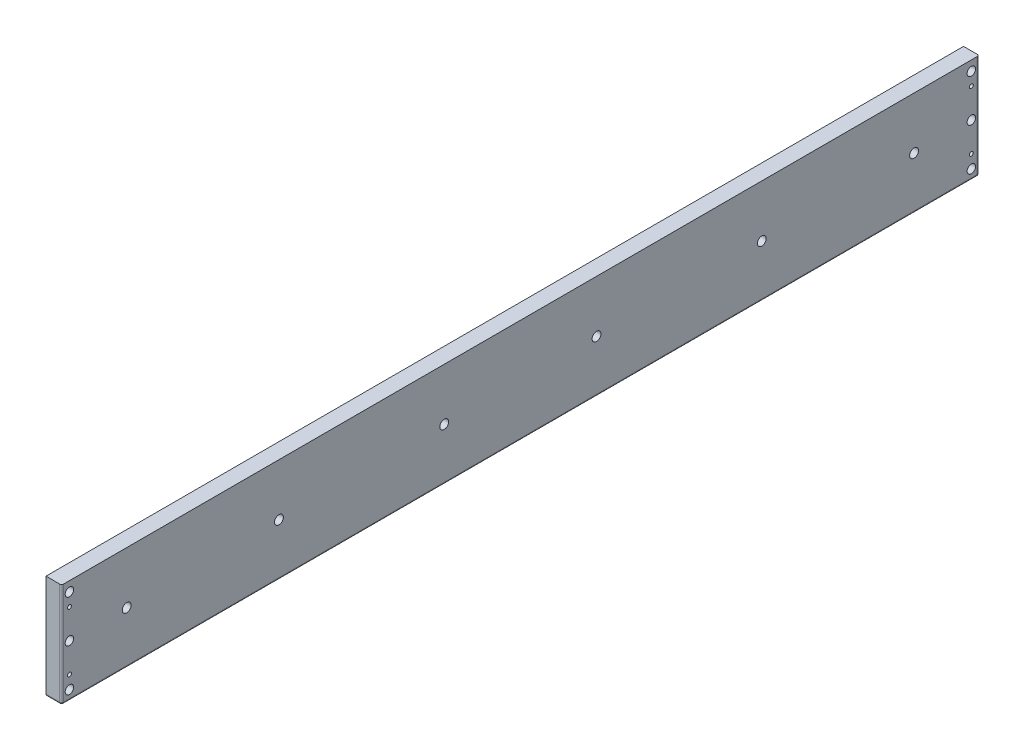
ISO-10303-21;
HEADER;
FILE_DESCRIPTION(('STEP AP214'),'2;1');
FILE_NAME('part.step','',(''),(''),'','','');
FILE_SCHEMA(('AUTOMOTIVE_DESIGN { 1 0 10303 214 1 1 1 1 }'));
ENDSEC;
DATA;
#1=APPLICATION_CONTEXT('core data for automotive mechanical design processes');
#2=APPLICATION_PROTOCOL_DEFINITION('international standard','automotive_design',2000,#1);
#3=PRODUCT_CONTEXT('',#1,'mechanical');
#4=PRODUCT('Part','Part','',(#3));
#5=PRODUCT_RELATED_PRODUCT_CATEGORY('part','',(#4));
#6=PRODUCT_DEFINITION_FORMATION('','',#4);
#7=PRODUCT_DEFINITION_CONTEXT('part definition',#1,'design');
#8=PRODUCT_DEFINITION('design','',#6,#7);
#9=PRODUCT_DEFINITION_SHAPE('','',#8);
#10=(LENGTH_UNIT() NAMED_UNIT(*) SI_UNIT(.MILLI.,.METRE.));
#11=(NAMED_UNIT(*) PLANE_ANGLE_UNIT() SI_UNIT($,.RADIAN.));
#12=(NAMED_UNIT(*) SI_UNIT($,.STERADIAN.) SOLID_ANGLE_UNIT());
#13=UNCERTAINTY_MEASURE_WITH_UNIT(LENGTH_MEASURE(1.E-05),#10,'distance_accuracy_value','');
#14=(GEOMETRIC_REPRESENTATION_CONTEXT(3) GLOBAL_UNCERTAINTY_ASSIGNED_CONTEXT((#13)) GLOBAL_UNIT_ASSIGNED_CONTEXT((#10,
#11,#12)) REPRESENTATION_CONTEXT('',''));
#15=CARTESIAN_POINT('',(0.,0.,0.));
#16=DIRECTION('',(0.,0.,1.));
#17=DIRECTION('',(1.,0.,0.));
#18=AXIS2_PLACEMENT_3D('',#15,#16,#17);
#19=CARTESIAN_POINT('',(4.50000000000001,-38.5,351.));
#20=DIRECTION('',(1.,0.,0.));
#21=DIRECTION('',(0.,0.,-1.));
#22=AXIS2_PLACEMENT_3D('',#19,#20,#21);
#23=SPHERICAL_SURFACE('',#22,1.5);
#24=CARTESIAN_POINT('',(4.50000000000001,-38.5,351.));
#25=DIRECTION('',(0.,0.,-1.));
#26=DIRECTION('',(-1.,0.,0.));
#27=AXIS2_PLACEMENT_3D('',#24,#25,#26);
#28=CIRCLE('',#27,1.5);
#29=CARTESIAN_POINT('',(6.00000000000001,-38.5,351.));
#30=VERTEX_POINT('',#29);
#31=CARTESIAN_POINT('',(4.50000000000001,-40.,351.));
#32=VERTEX_POINT('',#31);
#33=EDGE_CURVE('E105',#30,#32,#28,.T.);
#34=ORIENTED_EDGE('',*,*,#33,.F.);
#35=CARTESIAN_POINT('',(4.50000000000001,-38.5,351.));
#36=DIRECTION('',(0.,-1.,0.));
#37=DIRECTION('',(1.,0.,0.));
#38=AXIS2_PLACEMENT_3D('',#35,#36,#37);
#39=CIRCLE('',#38,1.5);
#40=CARTESIAN_POINT('',(4.50000000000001,-38.5,352.5));
#41=VERTEX_POINT('',#40);
#42=EDGE_CURVE('E122',#41,#30,#39,.F.);
#43=ORIENTED_EDGE('',*,*,#42,.F.);
#44=CARTESIAN_POINT('',(4.50000000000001,-38.5,351.));
#45=DIRECTION('',(-1.,0.,0.));
#46=DIRECTION('',(0.,0.,1.));
#47=AXIS2_PLACEMENT_3D('',#44,#45,#46);
#48=CIRCLE('',#47,1.5);
#49=EDGE_CURVE('E112',#32,#41,#48,.T.);
#50=ORIENTED_EDGE('',*,*,#49,.F.);
#51=EDGE_LOOP('',(#34,#43,#50));
#52=FACE_BOUND('',#51,.T.);
#53=ADVANCED_FACE('F16',(#52),#23,.T.);
#54=CARTESIAN_POINT('',(4.50000000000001,-38.5,-351.));
#55=DIRECTION('',(1.,0.,0.));
#56=DIRECTION('',(0.,0.,-1.));
#57=AXIS2_PLACEMENT_3D('',#54,#55,#56);
#58=SPHERICAL_SURFACE('',#57,1.5);
#59=CARTESIAN_POINT('',(4.50000000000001,-38.5,-351.));
#60=DIRECTION('',(0.,1.,0.));
#61=DIRECTION('',(-1.,0.,0.));
#62=AXIS2_PLACEMENT_3D('',#59,#60,#61);
#63=CIRCLE('',#62,1.5);
#64=CARTESIAN_POINT('',(6.00000000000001,-38.5,-351.));
#65=VERTEX_POINT('',#64);
#66=CARTESIAN_POINT('',(4.50000000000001,-38.5,-352.5));
#67=VERTEX_POINT('',#66);
#68=EDGE_CURVE('E70',#65,#67,#63,.T.);
#69=ORIENTED_EDGE('',*,*,#68,.F.);
#70=CARTESIAN_POINT('',(4.50000000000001,-38.5,-351.));
#71=DIRECTION('',(0.,0.,-1.));
#72=DIRECTION('',(-1.,0.,0.));
#73=AXIS2_PLACEMENT_3D('',#70,#71,#72);
#74=CIRCLE('',#73,1.5);
#75=CARTESIAN_POINT('',(4.50000000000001,-40.,-351.));
#76=VERTEX_POINT('',#75);
#77=EDGE_CURVE('E97',#76,#65,#74,.F.);
#78=ORIENTED_EDGE('',*,*,#77,.F.);
#79=CARTESIAN_POINT('',(4.50000000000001,-38.5,-351.));
#80=DIRECTION('',(1.,0.,0.));
#81=DIRECTION('',(0.,0.,-1.));
#82=AXIS2_PLACEMENT_3D('',#79,#80,#81);
#83=CIRCLE('',#82,1.5);
#84=EDGE_CURVE('E100',#67,#76,#83,.F.);
#85=ORIENTED_EDGE('',*,*,#84,.F.);
#86=EDGE_LOOP('',(#69,#78,#85));
#87=FACE_BOUND('',#86,.T.);
#88=ADVANCED_FACE('F99',(#87),#58,.T.);
#89=CARTESIAN_POINT('',(4.50000000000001,-38.5,352.5));
#90=DIRECTION('',(0.,0.,-1.));
#91=DIRECTION('',(-1.,0.,0.));
#92=AXIS2_PLACEMENT_3D('',#89,#90,#91);
#93=CYLINDRICAL_SURFACE('',#92,1.5);
#94=ORIENTED_EDGE('',*,*,#33,.T.);
#95=DIRECTION('',(0.,0.,1.));
#96=VECTOR('',#95,1.);
#97=CARTESIAN_POINT('',(4.50000000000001,-40.,352.5));
#98=LINE('',#97,#96);
#99=EDGE_CURVE('E115',#32,#76,#98,.F.);
#100=ORIENTED_EDGE('',*,*,#99,.T.);
#101=ORIENTED_EDGE('',*,*,#77,.T.);
#102=DIRECTION('',(0.,0.,1.));
#103=VECTOR('',#102,1.);
#104=CARTESIAN_POINT('',(6.00000000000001,-38.5,352.5));
#105=LINE('',#104,#103);
#106=EDGE_CURVE('E153',#65,#30,#105,.T.);
#107=ORIENTED_EDGE('',*,*,#106,.T.);
#108=EDGE_LOOP('',(#94,#100,#101,#107));
#109=FACE_BOUND('',#108,.T.);
#110=ADVANCED_FACE('F116',(#109),#93,.T.);
#111=CARTESIAN_POINT('',(4.50000000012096,22.5,300.));
#112=DIRECTION('',(-1.,0.,0.));
#113=DIRECTION('',(0.,0.,1.));
#114=AXIS2_PLACEMENT_3D('',#111,#112,#113);
#115=CONICAL_SURFACE('',#114,1.64999999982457,1.04719755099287);
#116=CARTESIAN_POINT('',(5.45262794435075,22.5,299.999999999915));
#117=VERTEX_POINT('',#116);
#118=VERTEX_LOOP('',#117);
#119=FACE_BOUND('',#118,.T.);
#120=CARTESIAN_POINT('',(4.5,22.5,300.));
#121=DIRECTION('',(-1.,0.,0.));
#122=DIRECTION('',(0.,0.,1.));
#123=AXIS2_PLACEMENT_3D('',#120,#121,#122);
#124=CIRCLE('',#123,1.64999999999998);
#125=CARTESIAN_POINT('',(4.5,22.5,301.65));
#126=VERTEX_POINT('',#125);
#127=EDGE_CURVE('E163',#126,#126,#124,.T.);
#128=ORIENTED_EDGE('',*,*,#127,.T.);
#129=EDGE_LOOP('',(#128));
#130=FACE_BOUND('',#129,.T.);
#131=ADVANCED_FACE('F181',(#119,#130),#115,.F.);
#132=CARTESIAN_POINT('',(4.50000000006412,22.4999999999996,240.));
#133=DIRECTION('',(-1.,0.,0.));
#134=DIRECTION('',(0.,0.,1.));
#135=AXIS2_PLACEMENT_3D('',#132,#133,#134);
#136=CONICAL_SURFACE('',#135,1.64999999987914,1.04719755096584);
#137=CARTESIAN_POINT('',(5.45262794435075,22.4999999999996,239.999999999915));
#138=VERTEX_POINT('',#137);
#139=VERTEX_LOOP('',#138);
#140=FACE_BOUND('',#139,.T.);
#141=CARTESIAN_POINT('',(4.5,22.4999999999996,240.));
#142=DIRECTION('',(-1.,0.,0.));
#143=DIRECTION('',(0.,0.,1.));
#144=AXIS2_PLACEMENT_3D('',#141,#142,#143);
#145=CIRCLE('',#144,1.64999999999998);
#146=CARTESIAN_POINT('',(4.5,22.4999999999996,241.65));
#147=VERTEX_POINT('',#146);
#148=EDGE_CURVE('E160',#147,#147,#145,.T.);
#149=ORIENTED_EDGE('',*,*,#148,.T.);
#150=EDGE_LOOP('',(#149));
#151=FACE_BOUND('',#150,.T.);
#152=ADVANCED_FACE('F184',(#140,#151),#136,.F.);
#153=CARTESIAN_POINT('',(4.50000000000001,-40.,351.));
#154=DIRECTION('',(0.,-1.,0.));
#155=DIRECTION('',(1.,0.,0.));
#156=AXIS2_PLACEMENT_3D('',#153,#154,#155);
#157=CYLINDRICAL_SURFACE('',#156,1.5);
#158=CARTESIAN_POINT('',(4.5,40.,351.));
#159=DIRECTION('',(0.,-1.,0.));
#160=DIRECTION('',(1.,0.,0.));
#161=AXIS2_PLACEMENT_3D('',#158,#159,#160);
#162=CIRCLE('',#161,1.5);
#163=CARTESIAN_POINT('',(6.,40.,351.));
#164=VERTEX_POINT('',#163);
#165=CARTESIAN_POINT('',(4.5,40.,352.5));
#166=VERTEX_POINT('',#165);
#167=EDGE_CURVE('E515',#164,#166,#162,.T.);
#168=ORIENTED_EDGE('',*,*,#167,.T.);
#169=DIRECTION('',(0.,1.,0.));
#170=VECTOR('',#169,1.);
#171=CARTESIAN_POINT('',(4.50000000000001,-40.,352.5));
#172=LINE('',#171,#170);
#173=EDGE_CURVE('E140',#41,#166,#172,.T.);
#174=ORIENTED_EDGE('',*,*,#173,.F.);
#175=ORIENTED_EDGE('',*,*,#42,.T.);
#176=DIRECTION('',(0.,-1.,0.));
#177=VECTOR('',#176,1.);
#178=CARTESIAN_POINT('',(6.,40.,351.));
#179=LINE('',#178,#177);
#180=EDGE_CURVE('E156',#30,#164,#179,.F.);
#181=ORIENTED_EDGE('',*,*,#180,.T.);
#182=EDGE_LOOP('',(#168,#174,#175,#181));
#183=FACE_BOUND('',#182,.T.);
#184=ADVANCED_FACE('F188',(#183),#157,.T.);
#185=CARTESIAN_POINT('',(-5.99999999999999,-40.,352.5));
#186=DIRECTION('',(0.,1.,0.));
#187=DIRECTION('',(0.,0.,1.));
#188=AXIS2_PLACEMENT_3D('',#185,#186,#187);
#189=PLANE('',#188);
#190=DIRECTION('',(0.,0.,-1.));
#191=VECTOR('',#190,1.);
#192=CARTESIAN_POINT('',(-4.49999999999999,-40.,352.5));
#193=LINE('',#192,#191);
#194=CARTESIAN_POINT('',(-4.49999999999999,-40.,-351.));
#195=VERTEX_POINT('',#194);
#196=CARTESIAN_POINT('',(-4.49999999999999,-40.,351.));
#197=VERTEX_POINT('',#196);
#198=EDGE_CURVE('E126',#195,#197,#193,.F.);
#199=ORIENTED_EDGE('',*,*,#198,.F.);
#200=DIRECTION('',(1.,0.,0.));
#201=VECTOR('',#200,1.);
#202=CARTESIAN_POINT('',(-5.99999999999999,-40.,-351.));
#203=LINE('',#202,#201);
#204=EDGE_CURVE('E110',#76,#195,#203,.F.);
#205=ORIENTED_EDGE('',*,*,#204,.F.);
#206=ORIENTED_EDGE('',*,*,#99,.F.);
#207=DIRECTION('',(-1.,0.,0.));
#208=VECTOR('',#207,1.);
#209=CARTESIAN_POINT('',(-5.99999999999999,-40.,351.));
#210=LINE('',#209,#208);
#211=EDGE_CURVE('E121',#197,#32,#210,.F.);
#212=ORIENTED_EDGE('',*,*,#211,.F.);
#213=EDGE_LOOP('',(#199,#205,#206,#212));
#214=FACE_BOUND('',#213,.T.);
#215=ADVANCED_FACE('F125',(#214),#189,.F.);
#216=CARTESIAN_POINT('',(-5.99999999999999,-38.5,351.));
#217=DIRECTION('',(-1.,0.,0.));
#218=DIRECTION('',(0.,0.,1.));
#219=AXIS2_PLACEMENT_3D('',#216,#217,#218);
#220=CYLINDRICAL_SURFACE('',#219,1.5);
#221=ORIENTED_EDGE('',*,*,#49,.T.);
#222=DIRECTION('',(1.,0.,0.));
#223=VECTOR('',#222,1.);
#224=CARTESIAN_POINT('',(-5.99999999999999,-38.5,352.5));
#225=LINE('',#224,#223);
#226=CARTESIAN_POINT('',(-5.99999999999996,-38.5,352.5));
#227=VERTEX_POINT('',#226);
#228=EDGE_CURVE('E143',#227,#41,#225,.T.);
#229=ORIENTED_EDGE('',*,*,#228,.F.);
#230=CARTESIAN_POINT('',(-4.49999999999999,-38.5,351.));
#231=DIRECTION('',(-0.707106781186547,0.,-0.707106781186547));
#232=DIRECTION('',(0.707106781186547,0.,-0.707106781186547));
#233=AXIS2_PLACEMENT_3D('',#230,#231,#232);
#234=ELLIPSE('',#233,2.12132034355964,1.5);
#235=EDGE_CURVE('E511',#197,#227,#234,.T.);
#236=ORIENTED_EDGE('',*,*,#235,.F.);
#237=ORIENTED_EDGE('',*,*,#211,.T.);
#238=EDGE_LOOP('',(#221,#229,#236,#237));
#239=FACE_BOUND('',#238,.T.);
#240=ADVANCED_FACE('F195',(#239),#220,.T.);
#241=CARTESIAN_POINT('',(-5.99999999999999,-38.5,-351.));
#242=DIRECTION('',(1.,0.,0.));
#243=DIRECTION('',(0.,0.,-1.));
#244=AXIS2_PLACEMENT_3D('',#241,#242,#243);
#245=CYLINDRICAL_SURFACE('',#244,1.5);
#246=ORIENTED_EDGE('',*,*,#84,.T.);
#247=ORIENTED_EDGE('',*,*,#204,.T.);
#248=CARTESIAN_POINT('',(-4.49999999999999,-38.5,-351.));
#249=DIRECTION('',(0.707106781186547,0.,-0.707106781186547));
#250=DIRECTION('',(-0.707106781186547,0.,-0.707106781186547));
#251=AXIS2_PLACEMENT_3D('',#248,#249,#250);
#252=ELLIPSE('',#251,2.12132034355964,1.5);
#253=CARTESIAN_POINT('',(-5.99999999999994,-38.5,-352.5));
#254=VERTEX_POINT('',#253);
#255=EDGE_CURVE('E513',#254,#195,#252,.F.);
#256=ORIENTED_EDGE('',*,*,#255,.F.);
#257=DIRECTION('',(1.,0.,0.));
#258=VECTOR('',#257,1.);
#259=CARTESIAN_POINT('',(-5.99999999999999,-38.5,-352.5));
#260=LINE('',#259,#258);
#261=EDGE_CURVE('E35',#254,#67,#260,.T.);
#262=ORIENTED_EDGE('',*,*,#261,.T.);
#263=EDGE_LOOP('',(#246,#247,#256,#262));
#264=FACE_BOUND('',#263,.T.);
#265=ADVANCED_FACE('F108',(#264),#245,.T.);
#266=CARTESIAN_POINT('',(4.5,40.,-351.));
#267=DIRECTION('',(0.,1.,0.));
#268=DIRECTION('',(-1.,0.,0.));
#269=AXIS2_PLACEMENT_3D('',#266,#267,#268);
#270=CYLINDRICAL_SURFACE('',#269,1.5);
#271=ORIENTED_EDGE('',*,*,#68,.T.);
#272=DIRECTION('',(0.,1.,0.));
#273=VECTOR('',#272,1.);
#274=CARTESIAN_POINT('',(4.50000000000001,-40.,-352.5));
#275=LINE('',#274,#273);
#276=CARTESIAN_POINT('',(4.5,40.,-352.5));
#277=VERTEX_POINT('',#276);
#278=EDGE_CURVE('E615',#67,#277,#275,.T.);
#279=ORIENTED_EDGE('',*,*,#278,.T.);
#280=CARTESIAN_POINT('',(4.5,40.,-351.));
#281=DIRECTION('',(0.,1.,0.));
#282=DIRECTION('',(-1.,0.,0.));
#283=AXIS2_PLACEMENT_3D('',#280,#281,#282);
#284=CIRCLE('',#283,1.5);
#285=CARTESIAN_POINT('',(6.,40.,-351.));
#286=VERTEX_POINT('',#285);
#287=EDGE_CURVE('E60',#277,#286,#284,.F.);
#288=ORIENTED_EDGE('',*,*,#287,.T.);
#289=DIRECTION('',(0.,-1.,0.));
#290=VECTOR('',#289,1.);
#291=CARTESIAN_POINT('',(6.,40.,-351.));
#292=LINE('',#291,#290);
#293=EDGE_CURVE('E128',#286,#65,#292,.T.);
#294=ORIENTED_EDGE('',*,*,#293,.T.);
#295=EDGE_LOOP('',(#271,#279,#288,#294));
#296=FACE_BOUND('',#295,.T.);
#297=ADVANCED_FACE('F201',(#296),#270,.T.);
#298=CARTESIAN_POINT('',(6.,40.,352.5));
#299=DIRECTION('',(-1.,0.,0.));
#300=DIRECTION('',(0.,-1.,0.));
#301=AXIS2_PLACEMENT_3D('',#298,#299,#300);
#302=PLANE('',#301);
#303=CARTESIAN_POINT('',(6.00000000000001,32.5,-346.5));
#304=DIRECTION('',(-1.,0.,0.));
#305=DIRECTION('',(0.,-1.,0.));
#306=AXIS2_PLACEMENT_3D('',#303,#304,#305);
#307=CIRCLE('',#306,3.24999999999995);
#308=CARTESIAN_POINT('',(6.00000000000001,29.25,-346.5));
#309=VERTEX_POINT('',#308);
#310=EDGE_CURVE('E507',#309,#309,#307,.T.);
#311=ORIENTED_EDGE('',*,*,#310,.T.);
#312=EDGE_LOOP('',(#311));
#313=FACE_BOUND('',#312,.T.);
#314=CARTESIAN_POINT('',(6.00000000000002,-32.5,-346.5));
#315=DIRECTION('',(-1.,0.,0.));
#316=DIRECTION('',(0.,-1.,0.));
#317=AXIS2_PLACEMENT_3D('',#314,#315,#316);
#318=CIRCLE('',#317,3.24999999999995);
#319=CARTESIAN_POINT('',(6.00000000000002,-35.75,-346.5));
#320=VERTEX_POINT('',#319);
#321=EDGE_CURVE('E504',#320,#320,#318,.T.);
#322=ORIENTED_EDGE('',*,*,#321,.T.);
#323=EDGE_LOOP('',(#322));
#324=FACE_BOUND('',#323,.T.);
#325=CARTESIAN_POINT('',(6.00000000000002,-32.4999999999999,346.5));
#326=DIRECTION('',(-1.,0.,0.));
#327=DIRECTION('',(0.,-1.,0.));
#328=AXIS2_PLACEMENT_3D('',#325,#326,#327);
#329=CIRCLE('',#328,3.24999999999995);
#330=CARTESIAN_POINT('',(6.00000000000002,-35.7499999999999,346.5));
#331=VERTEX_POINT('',#330);
#332=EDGE_CURVE('E501',#331,#331,#329,.T.);
#333=ORIENTED_EDGE('',*,*,#332,.T.);
#334=EDGE_LOOP('',(#333));
#335=FACE_BOUND('',#334,.T.);
#336=CARTESIAN_POINT('',(6.00000000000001,32.4999999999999,346.5));
#337=DIRECTION('',(-1.,0.,0.));
#338=DIRECTION('',(0.,-1.,0.));
#339=AXIS2_PLACEMENT_3D('',#336,#337,#338);
#340=CIRCLE('',#339,3.24999999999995);
#341=CARTESIAN_POINT('',(6.00000000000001,29.25,346.5));
#342=VERTEX_POINT('',#341);
#343=EDGE_CURVE('E498',#342,#342,#340,.T.);
#344=ORIENTED_EDGE('',*,*,#343,.T.);
#345=EDGE_LOOP('',(#344));
#346=FACE_BOUND('',#345,.T.);
#347=CARTESIAN_POINT('',(6.00000000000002,0.,-346.5));
#348=DIRECTION('',(-1.,0.,0.));
#349=DIRECTION('',(0.,-1.,0.));
#350=AXIS2_PLACEMENT_3D('',#347,#348,#349);
#351=CIRCLE('',#350,3.24999999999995);
#352=CARTESIAN_POINT('',(6.00000000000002,-3.24999999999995,-346.5));
#353=VERTEX_POINT('',#352);
#354=EDGE_CURVE('E495',#353,#353,#351,.T.);
#355=ORIENTED_EDGE('',*,*,#354,.T.);
#356=EDGE_LOOP('',(#355));
#357=FACE_BOUND('',#356,.T.);
#358=CARTESIAN_POINT('',(6.00000000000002,0.,346.5));
#359=DIRECTION('',(-1.,0.,0.));
#360=DIRECTION('',(0.,-1.,0.));
#361=AXIS2_PLACEMENT_3D('',#358,#359,#360);
#362=CIRCLE('',#361,3.24999999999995);
#363=CARTESIAN_POINT('',(6.00000000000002,-3.24999999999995,346.5));
#364=VERTEX_POINT('',#363);
#365=EDGE_CURVE('E491',#364,#364,#362,.T.);
#366=ORIENTED_EDGE('',*,*,#365,.T.);
#367=EDGE_LOOP('',(#366));
#368=FACE_BOUND('',#367,.T.);
#369=ORIENTED_EDGE('',*,*,#180,.F.);
#370=ORIENTED_EDGE('',*,*,#106,.F.);
#371=ORIENTED_EDGE('',*,*,#293,.F.);
#372=DIRECTION('',(0.,0.,-1.));
#373=VECTOR('',#372,1.);
#374=CARTESIAN_POINT('',(6.,40.,352.5));
#375=LINE('',#374,#373);
#376=EDGE_CURVE('E518',#286,#164,#375,.F.);
#377=ORIENTED_EDGE('',*,*,#376,.T.);
#378=EDGE_LOOP('',(#369,#370,#371,#377));
#379=FACE_BOUND('',#378,.T.);
#380=CARTESIAN_POINT('',(6.00000000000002,22.5,-346.5));
#381=DIRECTION('',(-1.,0.,0.));
#382=DIRECTION('',(0.,-1.,0.));
#383=AXIS2_PLACEMENT_3D('',#380,#381,#382);
#384=CIRCLE('',#383,1.50000000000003);
#385=CARTESIAN_POINT('',(6.00000000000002,21.,-346.5));
#386=VERTEX_POINT('',#385);
#387=EDGE_CURVE('E166',#386,#386,#384,.T.);
#388=ORIENTED_EDGE('',*,*,#387,.T.);
#389=EDGE_LOOP('',(#388));
#390=FACE_BOUND('',#389,.T.);
#391=CARTESIAN_POINT('',(6.00000000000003,-22.5,-346.5));
#392=DIRECTION('',(-1.,0.,0.));
#393=DIRECTION('',(0.,-1.,0.));
#394=AXIS2_PLACEMENT_3D('',#391,#392,#393);
#395=CIRCLE('',#394,1.50000000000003);
#396=CARTESIAN_POINT('',(6.00000000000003,-24.,-346.5));
#397=VERTEX_POINT('',#396);
#398=EDGE_CURVE('E522',#397,#397,#395,.T.);
#399=ORIENTED_EDGE('',*,*,#398,.T.);
#400=EDGE_LOOP('',(#399));
#401=FACE_BOUND('',#400,.T.);
#402=CARTESIAN_POINT('',(6.00000000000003,-22.4999999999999,346.5));
#403=DIRECTION('',(-1.,0.,0.));
#404=DIRECTION('',(0.,-1.,0.));
#405=AXIS2_PLACEMENT_3D('',#402,#403,#404);
#406=CIRCLE('',#405,1.50000000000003);
#407=CARTESIAN_POINT('',(6.00000000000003,-24.,346.5));
#408=VERTEX_POINT('',#407);
#409=EDGE_CURVE('E525',#408,#408,#406,.T.);
#410=ORIENTED_EDGE('',*,*,#409,.T.);
#411=EDGE_LOOP('',(#410));
#412=FACE_BOUND('',#411,.T.);
#413=CARTESIAN_POINT('',(6.00000000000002,22.5000000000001,346.5));
#414=DIRECTION('',(-1.,0.,0.));
#415=DIRECTION('',(0.,-1.,0.));
#416=AXIS2_PLACEMENT_3D('',#413,#414,#415);
#417=CIRCLE('',#416,1.50000000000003);
#418=CARTESIAN_POINT('',(6.00000000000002,21.,346.5));
#419=VERTEX_POINT('',#418);
#420=EDGE_CURVE('E528',#419,#419,#417,.T.);
#421=ORIENTED_EDGE('',*,*,#420,.T.);
#422=EDGE_LOOP('',(#421));
#423=FACE_BOUND('',#422,.T.);
#424=CARTESIAN_POINT('',(6.,0.,-58.5));
#425=DIRECTION('',(1.,0.,0.));
#426=DIRECTION('',(0.,0.,-1.));
#427=AXIS2_PLACEMENT_3D('',#424,#425,#426);
#428=CIRCLE('',#427,3.4);
#429=CARTESIAN_POINT('',(6.,0.,-61.9));
#430=VERTEX_POINT('',#429);
#431=EDGE_CURVE('E531',#430,#430,#428,.F.);
#432=ORIENTED_EDGE('',*,*,#431,.T.);
#433=EDGE_LOOP('',(#432));
#434=FACE_BOUND('',#433,.T.);
#435=CARTESIAN_POINT('',(6.,0.,58.5));
#436=DIRECTION('',(1.,0.,0.));
#437=DIRECTION('',(0.,0.,-1.));
#438=AXIS2_PLACEMENT_3D('',#435,#436,#437);
#439=CIRCLE('',#438,3.4);
#440=CARTESIAN_POINT('',(6.,0.,55.1));
#441=VERTEX_POINT('',#440);
#442=EDGE_CURVE('E534',#441,#441,#439,.F.);
#443=ORIENTED_EDGE('',*,*,#442,.T.);
#444=EDGE_LOOP('',(#443));
#445=FACE_BOUND('',#444,.T.);
#446=CARTESIAN_POINT('',(6.,0.,-185.5));
#447=DIRECTION('',(1.,0.,0.));
#448=DIRECTION('',(0.,0.,-1.));
#449=AXIS2_PLACEMENT_3D('',#446,#447,#448);
#450=CIRCLE('',#449,3.39999999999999);
#451=CARTESIAN_POINT('',(6.,0.,-188.9));
#452=VERTEX_POINT('',#451);
#453=EDGE_CURVE('E537',#452,#452,#450,.F.);
#454=ORIENTED_EDGE('',*,*,#453,.T.);
#455=EDGE_LOOP('',(#454));
#456=FACE_BOUND('',#455,.T.);
#457=CARTESIAN_POINT('',(6.,0.,-302.5));
#458=DIRECTION('',(1.,0.,0.));
#459=DIRECTION('',(0.,0.,-1.));
#460=AXIS2_PLACEMENT_3D('',#457,#458,#459);
#461=CIRCLE('',#460,3.40000000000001);
#462=CARTESIAN_POINT('',(6.,0.,-305.9));
#463=VERTEX_POINT('',#462);
#464=EDGE_CURVE('E540',#463,#463,#461,.F.);
#465=ORIENTED_EDGE('',*,*,#464,.T.);
#466=EDGE_LOOP('',(#465));
#467=FACE_BOUND('',#466,.T.);
#468=CARTESIAN_POINT('',(6.,0.,302.5));
#469=DIRECTION('',(1.,0.,0.));
#470=DIRECTION('',(0.,0.,-1.));
#471=AXIS2_PLACEMENT_3D('',#468,#469,#470);
#472=CIRCLE('',#471,3.40000000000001);
#473=CARTESIAN_POINT('',(6.,0.,299.1));
#474=VERTEX_POINT('',#473);
#475=EDGE_CURVE('E542',#474,#474,#472,.F.);
#476=ORIENTED_EDGE('',*,*,#475,.T.);
#477=EDGE_LOOP('',(#476));
#478=FACE_BOUND('',#477,.T.);
#479=CARTESIAN_POINT('',(6.,0.,185.5));
#480=DIRECTION('',(1.,0.,0.));
#481=DIRECTION('',(0.,0.,-1.));
#482=AXIS2_PLACEMENT_3D('',#479,#480,#481);
#483=CIRCLE('',#482,3.39999999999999);
#484=CARTESIAN_POINT('',(6.,0.,182.1));
#485=VERTEX_POINT('',#484);
#486=EDGE_CURVE('E20',#485,#485,#483,.F.);
#487=ORIENTED_EDGE('',*,*,#486,.T.);
#488=EDGE_LOOP('',(#487));
#489=FACE_BOUND('',#488,.T.);
#490=ADVANCED_FACE('F204',(#313,#324,#335,#346,#357,#368,#379,#390,#401,#412,#423,#434,#445,
#456,#467,#478,#489),#302,.F.);
#491=CARTESIAN_POINT('',(4.50000000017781,22.4999999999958,-300.));
#492=DIRECTION('',(-1.,0.,0.));
#493=DIRECTION('',(0.,0.,1.));
#494=AXIS2_PLACEMENT_3D('',#491,#492,#493);
#495=CONICAL_SURFACE('',#494,1.64999999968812,1.04719755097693);
#496=CARTESIAN_POINT('',(5.45262794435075,22.4999999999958,-300.000000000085));
#497=VERTEX_POINT('',#496);
#498=VERTEX_LOOP('',#497);
#499=FACE_BOUND('',#498,.T.);
#500=CARTESIAN_POINT('',(4.5,22.4999999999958,-300.));
#501=DIRECTION('',(-1.,0.,0.));
#502=DIRECTION('',(0.,0.,1.));
#503=AXIS2_PLACEMENT_3D('',#500,#501,#502);
#504=CIRCLE('',#503,1.64999999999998);
#505=CARTESIAN_POINT('',(4.5,22.4999999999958,-298.35));
#506=VERTEX_POINT('',#505);
#507=EDGE_CURVE('E494',#506,#506,#504,.T.);
#508=ORIENTED_EDGE('',*,*,#507,.T.);
#509=EDGE_LOOP('',(#508));
#510=FACE_BOUND('',#509,.T.);
#511=ADVANCED_FACE('F207',(#499,#510),#495,.F.);
#512=CARTESIAN_POINT('',(4.50000000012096,22.4999999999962,-240.));
#513=DIRECTION('',(-1.,0.,0.));
#514=DIRECTION('',(0.,0.,1.));
#515=AXIS2_PLACEMENT_3D('',#512,#513,#514);
#516=CONICAL_SURFACE('',#515,1.64999999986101,1.04719755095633);
#517=CARTESIAN_POINT('',(5.4526279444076,22.4999999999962,-240.000000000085));
#518=VERTEX_POINT('',#517);
#519=VERTEX_LOOP('',#518);
#520=FACE_BOUND('',#519,.T.);
#521=CARTESIAN_POINT('',(4.5,22.4999999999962,-240.));
#522=DIRECTION('',(-1.,0.,0.));
#523=DIRECTION('',(0.,0.,1.));
#524=AXIS2_PLACEMENT_3D('',#521,#522,#523);
#525=CIRCLE('',#524,1.64999999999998);
#526=CARTESIAN_POINT('',(4.5,22.4999999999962,-238.35));
#527=VERTEX_POINT('',#526);
#528=EDGE_CURVE('E652',#527,#527,#525,.T.);
#529=ORIENTED_EDGE('',*,*,#528,.T.);
#530=EDGE_LOOP('',(#529));
#531=FACE_BOUND('',#530,.T.);
#532=ADVANCED_FACE('F211',(#520,#531),#516,.F.);
#533=CARTESIAN_POINT('',(4.50000000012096,22.4999999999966,-180.));
#534=DIRECTION('',(-1.,0.,0.));
#535=DIRECTION('',(0.,0.,1.));
#536=AXIS2_PLACEMENT_3D('',#533,#534,#535);
#537=CONICAL_SURFACE('',#536,1.64999999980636,1.04719755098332);
#538=CARTESIAN_POINT('',(5.45262794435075,22.4999999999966,-180.000000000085));
#539=VERTEX_POINT('',#538);
#540=VERTEX_LOOP('',#539);
#541=FACE_BOUND('',#540,.T.);
#542=CARTESIAN_POINT('',(4.5,22.4999999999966,-180.));
#543=DIRECTION('',(-1.,0.,0.));
#544=DIRECTION('',(0.,0.,1.));
#545=AXIS2_PLACEMENT_3D('',#542,#543,#544);
#546=CIRCLE('',#545,1.64999999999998);
#547=CARTESIAN_POINT('',(4.5,22.4999999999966,-178.35));
#548=VERTEX_POINT('',#547);
#549=EDGE_CURVE('E649',#548,#548,#546,.T.);
#550=ORIENTED_EDGE('',*,*,#549,.T.);
#551=EDGE_LOOP('',(#550));
#552=FACE_BOUND('',#551,.T.);
#553=ADVANCED_FACE('F215',(#541,#552),#537,.F.);
#554=CARTESIAN_POINT('',(4.50000000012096,22.4999999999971,-120.));
#555=DIRECTION('',(-1.,0.,0.));
#556=DIRECTION('',(0.,0.,1.));
#557=AXIS2_PLACEMENT_3D('',#554,#555,#556);
#558=CONICAL_SURFACE('',#557,1.64999999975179,1.04719755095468);
#559=CARTESIAN_POINT('',(5.45262794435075,22.4999999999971,-120.000000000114));
#560=VERTEX_POINT('',#559);
#561=VERTEX_LOOP('',#560);
#562=FACE_BOUND('',#561,.T.);
#563=CARTESIAN_POINT('',(4.5,22.4999999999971,-120.));
#564=DIRECTION('',(-1.,0.,0.));
#565=DIRECTION('',(0.,0.,1.));
#566=AXIS2_PLACEMENT_3D('',#563,#564,#565);
#567=CIRCLE('',#566,1.64999999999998);
#568=CARTESIAN_POINT('',(4.5,22.4999999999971,-118.35));
#569=VERTEX_POINT('',#568);
#570=EDGE_CURVE('E646',#569,#569,#567,.T.);
#571=ORIENTED_EDGE('',*,*,#570,.T.);
#572=EDGE_LOOP('',(#571));
#573=FACE_BOUND('',#572,.T.);
#574=ADVANCED_FACE('F219',(#562,#573),#558,.F.);
#575=CARTESIAN_POINT('',(4.50000000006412,22.4999999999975,-60.));
#576=DIRECTION('',(-1.,0.,0.));
#577=DIRECTION('',(0.,0.,1.));
#578=AXIS2_PLACEMENT_3D('',#575,#576,#577);
#579=CONICAL_SURFACE('',#578,1.64999999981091,1.04719755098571);
#580=CARTESIAN_POINT('',(5.45262794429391,22.4999999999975,-60.0000000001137));
#581=VERTEX_POINT('',#580);
#582=VERTEX_LOOP('',#581);
#583=FACE_BOUND('',#582,.T.);
#584=CARTESIAN_POINT('',(4.5,22.4999999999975,-60.));
#585=DIRECTION('',(-1.,0.,0.));
#586=DIRECTION('',(0.,0.,1.));
#587=AXIS2_PLACEMENT_3D('',#584,#585,#586);
#588=CIRCLE('',#587,1.64999999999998);
#589=CARTESIAN_POINT('',(4.5,22.4999999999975,-58.35));
#590=VERTEX_POINT('',#589);
#591=EDGE_CURVE('E643',#590,#590,#588,.T.);
#592=ORIENTED_EDGE('',*,*,#591,.T.);
#593=EDGE_LOOP('',(#592));
#594=FACE_BOUND('',#593,.T.);
#595=ADVANCED_FACE('F223',(#583,#594),#579,.F.);
#596=CARTESIAN_POINT('',(4.50000000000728,22.4999999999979,0.));
#597=DIRECTION('',(-1.,0.,0.));
#598=DIRECTION('',(0.,0.,1.));
#599=AXIS2_PLACEMENT_3D('',#596,#597,#598);
#600=CONICAL_SURFACE('',#599,1.64999999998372,1.04719755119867);
#601=CARTESIAN_POINT('',(5.45262794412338,22.4999999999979,0.));
#602=VERTEX_POINT('',#601);
#603=VERTEX_LOOP('',#602);
#604=FACE_BOUND('',#603,.T.);
#605=CARTESIAN_POINT('',(4.5,22.4999999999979,0.));
#606=DIRECTION('',(-1.,0.,0.));
#607=DIRECTION('',(0.,0.,1.));
#608=AXIS2_PLACEMENT_3D('',#605,#606,#607);
#609=CIRCLE('',#608,1.64999999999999);
#610=CARTESIAN_POINT('',(4.5,22.4999999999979,1.64999999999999));
#611=VERTEX_POINT('',#610);
#612=EDGE_CURVE('E640',#611,#611,#609,.T.);
#613=ORIENTED_EDGE('',*,*,#612,.T.);
#614=EDGE_LOOP('',(#613));
#615=FACE_BOUND('',#614,.T.);
#616=ADVANCED_FACE('F227',(#604,#615),#600,.F.);
#617=CARTESIAN_POINT('',(4.50000000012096,22.4999999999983,60.));
#618=DIRECTION('',(-1.,0.,0.));
#619=DIRECTION('',(0.,0.,1.));
#620=AXIS2_PLACEMENT_3D('',#617,#618,#619);
#621=CONICAL_SURFACE('',#620,1.64999999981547,1.04719755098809);
#622=CARTESIAN_POINT('',(5.45262794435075,22.4999999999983,59.9999999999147));
#623=VERTEX_POINT('',#622);
#624=VERTEX_LOOP('',#623);
#625=FACE_BOUND('',#624,.T.);
#626=CARTESIAN_POINT('',(4.5,22.4999999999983,60.));
#627=DIRECTION('',(-1.,0.,0.));
#628=DIRECTION('',(0.,0.,1.));
#629=AXIS2_PLACEMENT_3D('',#626,#627,#628);
#630=CIRCLE('',#629,1.64999999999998);
#631=CARTESIAN_POINT('',(4.5,22.4999999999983,61.65));
#632=VERTEX_POINT('',#631);
#633=EDGE_CURVE('E637',#632,#632,#630,.T.);
#634=ORIENTED_EDGE('',*,*,#633,.T.);
#635=EDGE_LOOP('',(#634));
#636=FACE_BOUND('',#635,.T.);
#637=ADVANCED_FACE('F231',(#625,#636),#621,.F.);
#638=CARTESIAN_POINT('',(4.50000000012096,22.4999999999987,120.));
#639=DIRECTION('',(-1.,0.,0.));
#640=DIRECTION('',(0.,0.,1.));
#641=AXIS2_PLACEMENT_3D('',#638,#639,#640);
#642=CONICAL_SURFACE('',#641,1.64999999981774,1.04719755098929);
#643=CARTESIAN_POINT('',(5.45262794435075,22.4999999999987,119.999999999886));
#644=VERTEX_POINT('',#643);
#645=VERTEX_LOOP('',#644);
#646=FACE_BOUND('',#645,.T.);
#647=CARTESIAN_POINT('',(4.5,22.4999999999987,120.));
#648=DIRECTION('',(-1.,0.,0.));
#649=DIRECTION('',(0.,0.,1.));
#650=AXIS2_PLACEMENT_3D('',#647,#648,#649);
#651=CIRCLE('',#650,1.64999999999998);
#652=CARTESIAN_POINT('',(4.5,22.4999999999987,121.65));
#653=VERTEX_POINT('',#652);
#654=EDGE_CURVE('E487',#653,#653,#651,.T.);
#655=ORIENTED_EDGE('',*,*,#654,.T.);
#656=EDGE_LOOP('',(#655));
#657=FACE_BOUND('',#656,.T.);
#658=ADVANCED_FACE('F235',(#646,#657),#642,.F.);
#659=CARTESIAN_POINT('',(4.50000000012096,22.4999999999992,180.));
#660=DIRECTION('',(-1.,0.,0.));
#661=DIRECTION('',(0.,0.,1.));
#662=AXIS2_PLACEMENT_3D('',#659,#660,#661);
#663=CONICAL_SURFACE('',#662,1.64999999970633,1.04719755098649);
#664=CARTESIAN_POINT('',(5.45262794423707,22.4999999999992,180.000000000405));
#665=VERTEX_POINT('',#664);
#666=VERTEX_LOOP('',#665);
#667=FACE_BOUND('',#666,.T.);
#668=CARTESIAN_POINT('',(4.5,22.4999999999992,180.));
#669=DIRECTION('',(-1.,0.,0.));
#670=DIRECTION('',(0.,0.,1.));
#671=AXIS2_PLACEMENT_3D('',#668,#669,#670);
#672=CIRCLE('',#671,1.64999999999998);
#673=CARTESIAN_POINT('',(4.5,22.4999999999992,181.65));
#674=VERTEX_POINT('',#673);
#675=EDGE_CURVE('E483',#674,#674,#672,.T.);
#676=ORIENTED_EDGE('',*,*,#675,.T.);
#677=EDGE_LOOP('',(#676));
#678=FACE_BOUND('',#677,.T.);
#679=ADVANCED_FACE('F239',(#667,#678),#663,.F.);
#680=CARTESIAN_POINT('',(6.,0.,185.5));
#681=DIRECTION('',(1.,0.,0.));
#682=DIRECTION('',(0.,0.,-1.));
#683=AXIS2_PLACEMENT_3D('',#680,#681,#682);
#684=CYLINDRICAL_SURFACE('',#683,3.39999999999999);
#685=CARTESIAN_POINT('',(-5.99999999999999,0.,185.5));
#686=DIRECTION('',(1.,0.,0.));
#687=DIRECTION('',(0.,0.,-1.));
#688=AXIS2_PLACEMENT_3D('',#685,#686,#687);
#689=CIRCLE('',#688,3.39999999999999);
#690=CARTESIAN_POINT('',(-5.99999999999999,0.,182.1));
#691=VERTEX_POINT('',#690);
#692=EDGE_CURVE('E482',#691,#691,#689,.F.);
#693=ORIENTED_EDGE('',*,*,#692,.T.);
#694=EDGE_LOOP('',(#693));
#695=FACE_BOUND('',#694,.T.);
#696=ORIENTED_EDGE('',*,*,#486,.F.);
#697=EDGE_LOOP('',(#696));
#698=FACE_BOUND('',#697,.T.);
#699=ADVANCED_FACE('F243',(#695,#698),#684,.F.);
#700=CARTESIAN_POINT('',(6.,0.,302.5));
#701=DIRECTION('',(1.,0.,0.));
#702=DIRECTION('',(0.,0.,-1.));
#703=AXIS2_PLACEMENT_3D('',#700,#701,#702);
#704=CYLINDRICAL_SURFACE('',#703,3.40000000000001);
#705=CARTESIAN_POINT('',(-5.99999999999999,0.,302.5));
#706=DIRECTION('',(1.,0.,0.));
#707=DIRECTION('',(0.,0.,-1.));
#708=AXIS2_PLACEMENT_3D('',#705,#706,#707);
#709=CIRCLE('',#708,3.40000000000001);
#710=CARTESIAN_POINT('',(-5.99999999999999,0.,299.1));
#711=VERTEX_POINT('',#710);
#712=EDGE_CURVE('E479',#711,#711,#709,.F.);
#713=ORIENTED_EDGE('',*,*,#712,.T.);
#714=EDGE_LOOP('',(#713));
#715=FACE_BOUND('',#714,.T.);
#716=ORIENTED_EDGE('',*,*,#475,.F.);
#717=EDGE_LOOP('',(#716));
#718=FACE_BOUND('',#717,.T.);
#719=ADVANCED_FACE('F247',(#715,#718),#704,.F.);
#720=CARTESIAN_POINT('',(6.,0.,-302.5));
#721=DIRECTION('',(1.,0.,0.));
#722=DIRECTION('',(0.,0.,-1.));
#723=AXIS2_PLACEMENT_3D('',#720,#721,#722);
#724=CYLINDRICAL_SURFACE('',#723,3.40000000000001);
#725=CARTESIAN_POINT('',(-5.99999999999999,0.,-302.5));
#726=DIRECTION('',(1.,0.,0.));
#727=DIRECTION('',(0.,0.,-1.));
#728=AXIS2_PLACEMENT_3D('',#725,#726,#727);
#729=CIRCLE('',#728,3.40000000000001);
#730=CARTESIAN_POINT('',(-5.99999999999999,0.,-305.9));
#731=VERTEX_POINT('',#730);
#732=EDGE_CURVE('E475',#731,#731,#729,.F.);
#733=ORIENTED_EDGE('',*,*,#732,.T.);
#734=EDGE_LOOP('',(#733));
#735=FACE_BOUND('',#734,.T.);
#736=ORIENTED_EDGE('',*,*,#464,.F.);
#737=EDGE_LOOP('',(#736));
#738=FACE_BOUND('',#737,.T.);
#739=ADVANCED_FACE('F251',(#735,#738),#724,.F.);
#740=CARTESIAN_POINT('',(6.,0.,-185.5));
#741=DIRECTION('',(1.,0.,0.));
#742=DIRECTION('',(0.,0.,-1.));
#743=AXIS2_PLACEMENT_3D('',#740,#741,#742);
#744=CYLINDRICAL_SURFACE('',#743,3.39999999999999);
#745=CARTESIAN_POINT('',(-5.99999999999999,0.,-185.5));
#746=DIRECTION('',(1.,0.,0.));
#747=DIRECTION('',(0.,0.,-1.));
#748=AXIS2_PLACEMENT_3D('',#745,#746,#747);
#749=CIRCLE('',#748,3.39999999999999);
#750=CARTESIAN_POINT('',(-5.99999999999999,0.,-188.9));
#751=VERTEX_POINT('',#750);
#752=EDGE_CURVE('E471',#751,#751,#749,.F.);
#753=ORIENTED_EDGE('',*,*,#752,.T.);
#754=EDGE_LOOP('',(#753));
#755=FACE_BOUND('',#754,.T.);
#756=ORIENTED_EDGE('',*,*,#453,.F.);
#757=EDGE_LOOP('',(#756));
#758=FACE_BOUND('',#757,.T.);
#759=ADVANCED_FACE('F255',(#755,#758),#744,.F.);
#760=CARTESIAN_POINT('',(6.,0.,58.5));
#761=DIRECTION('',(1.,0.,0.));
#762=DIRECTION('',(0.,0.,-1.));
#763=AXIS2_PLACEMENT_3D('',#760,#761,#762);
#764=CYLINDRICAL_SURFACE('',#763,3.4);
#765=CARTESIAN_POINT('',(-5.99999999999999,0.,58.5));
#766=DIRECTION('',(1.,0.,0.));
#767=DIRECTION('',(0.,0.,-1.));
#768=AXIS2_PLACEMENT_3D('',#765,#766,#767);
#769=CIRCLE('',#768,3.4);
#770=CARTESIAN_POINT('',(-5.99999999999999,0.,55.1));
#771=VERTEX_POINT('',#770);
#772=EDGE_CURVE('E467',#771,#771,#769,.F.);
#773=ORIENTED_EDGE('',*,*,#772,.T.);
#774=EDGE_LOOP('',(#773));
#775=FACE_BOUND('',#774,.T.);
#776=ORIENTED_EDGE('',*,*,#442,.F.);
#777=EDGE_LOOP('',(#776));
#778=FACE_BOUND('',#777,.T.);
#779=ADVANCED_FACE('F259',(#775,#778),#764,.F.);
#780=CARTESIAN_POINT('',(6.,0.,-58.5));
#781=DIRECTION('',(1.,0.,0.));
#782=DIRECTION('',(0.,0.,-1.));
#783=AXIS2_PLACEMENT_3D('',#780,#781,#782);
#784=CYLINDRICAL_SURFACE('',#783,3.4);
#785=CARTESIAN_POINT('',(-5.99999999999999,0.,-58.5));
#786=DIRECTION('',(1.,0.,0.));
#787=DIRECTION('',(0.,0.,-1.));
#788=AXIS2_PLACEMENT_3D('',#785,#786,#787);
#789=CIRCLE('',#788,3.4);
#790=CARTESIAN_POINT('',(-5.99999999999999,0.,-61.9));
#791=VERTEX_POINT('',#790);
#792=EDGE_CURVE('E463',#791,#791,#789,.F.);
#793=ORIENTED_EDGE('',*,*,#792,.T.);
#794=EDGE_LOOP('',(#793));
#795=FACE_BOUND('',#794,.T.);
#796=ORIENTED_EDGE('',*,*,#431,.F.);
#797=EDGE_LOOP('',(#796));
#798=FACE_BOUND('',#797,.T.);
#799=ADVANCED_FACE('F263',(#795,#798),#784,.F.);
#800=CARTESIAN_POINT('',(6.00000000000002,22.5000000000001,346.5));
#801=DIRECTION('',(-1.,0.,0.));
#802=DIRECTION('',(0.,-1.,0.));
#803=AXIS2_PLACEMENT_3D('',#800,#801,#802);
#804=CYLINDRICAL_SURFACE('',#803,1.50000000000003);
#805=ORIENTED_EDGE('',*,*,#420,.F.);
#806=EDGE_LOOP('',(#805));
#807=FACE_BOUND('',#806,.T.);
#808=CARTESIAN_POINT('',(-6.,22.5000000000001,346.5));
#809=DIRECTION('',(-1.,0.,0.));
#810=DIRECTION('',(0.,-1.,0.));
#811=AXIS2_PLACEMENT_3D('',#808,#809,#810);
#812=CIRCLE('',#811,1.50000000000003);
#813=CARTESIAN_POINT('',(-6.,21.,346.5));
#814=VERTEX_POINT('',#813);
#815=EDGE_CURVE('E459',#814,#814,#812,.T.);
#816=ORIENTED_EDGE('',*,*,#815,.T.);
#817=EDGE_LOOP('',(#816));
#818=FACE_BOUND('',#817,.T.);
#819=ADVANCED_FACE('F267',(#807,#818),#804,.F.);
#820=CARTESIAN_POINT('',(6.00000000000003,-22.4999999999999,346.5));
#821=DIRECTION('',(-1.,0.,0.));
#822=DIRECTION('',(0.,-1.,0.));
#823=AXIS2_PLACEMENT_3D('',#820,#821,#822);
#824=CYLINDRICAL_SURFACE('',#823,1.50000000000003);
#825=ORIENTED_EDGE('',*,*,#409,.F.);
#826=EDGE_LOOP('',(#825));
#827=FACE_BOUND('',#826,.T.);
#828=CARTESIAN_POINT('',(-5.99999999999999,-22.4999999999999,346.5));
#829=DIRECTION('',(-1.,0.,0.));
#830=DIRECTION('',(0.,-1.,0.));
#831=AXIS2_PLACEMENT_3D('',#828,#829,#830);
#832=CIRCLE('',#831,1.50000000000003);
#833=CARTESIAN_POINT('',(-5.99999999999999,-24.,346.5));
#834=VERTEX_POINT('',#833);
#835=EDGE_CURVE('E455',#834,#834,#832,.T.);
#836=ORIENTED_EDGE('',*,*,#835,.T.);
#837=EDGE_LOOP('',(#836));
#838=FACE_BOUND('',#837,.T.);
#839=ADVANCED_FACE('F271',(#827,#838),#824,.F.);
#840=CARTESIAN_POINT('',(6.00000000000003,-22.5,-346.5));
#841=DIRECTION('',(-1.,0.,0.));
#842=DIRECTION('',(0.,-1.,0.));
#843=AXIS2_PLACEMENT_3D('',#840,#841,#842);
#844=CYLINDRICAL_SURFACE('',#843,1.50000000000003);
#845=ORIENTED_EDGE('',*,*,#398,.F.);
#846=EDGE_LOOP('',(#845));
#847=FACE_BOUND('',#846,.T.);
#848=CARTESIAN_POINT('',(-5.99999999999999,-22.5,-346.5));
#849=DIRECTION('',(-1.,0.,0.));
#850=DIRECTION('',(0.,-1.,0.));
#851=AXIS2_PLACEMENT_3D('',#848,#849,#850);
#852=CIRCLE('',#851,1.50000000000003);
#853=CARTESIAN_POINT('',(-5.99999999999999,-24.,-346.5));
#854=VERTEX_POINT('',#853);
#855=EDGE_CURVE('E451',#854,#854,#852,.T.);
#856=ORIENTED_EDGE('',*,*,#855,.T.);
#857=EDGE_LOOP('',(#856));
#858=FACE_BOUND('',#857,.T.);
#859=ADVANCED_FACE('F275',(#847,#858),#844,.F.);
#860=CARTESIAN_POINT('',(6.00000000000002,22.5,-346.5));
#861=DIRECTION('',(-1.,0.,0.));
#862=DIRECTION('',(0.,-1.,0.));
#863=AXIS2_PLACEMENT_3D('',#860,#861,#862);
#864=CYLINDRICAL_SURFACE('',#863,1.50000000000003);
#865=ORIENTED_EDGE('',*,*,#387,.F.);
#866=EDGE_LOOP('',(#865));
#867=FACE_BOUND('',#866,.T.);
#868=CARTESIAN_POINT('',(-6.,22.5,-346.5));
#869=DIRECTION('',(-1.,0.,0.));
#870=DIRECTION('',(0.,-1.,0.));
#871=AXIS2_PLACEMENT_3D('',#868,#869,#870);
#872=CIRCLE('',#871,1.50000000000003);
#873=CARTESIAN_POINT('',(-6.,21.,-346.5));
#874=VERTEX_POINT('',#873);
#875=EDGE_CURVE('E447',#874,#874,#872,.T.);
#876=ORIENTED_EDGE('',*,*,#875,.T.);
#877=EDGE_LOOP('',(#876));
#878=FACE_BOUND('',#877,.T.);
#879=ADVANCED_FACE('F279',(#867,#878),#864,.F.);
#880=CARTESIAN_POINT('',(-6.,22.5,300.));
#881=DIRECTION('',(-1.,0.,0.));
#882=DIRECTION('',(0.,0.,1.));
#883=AXIS2_PLACEMENT_3D('',#880,#881,#882);
#884=CYLINDRICAL_SURFACE('',#883,1.64999999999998);
#885=ORIENTED_EDGE('',*,*,#127,.F.);
#886=EDGE_LOOP('',(#885));
#887=FACE_BOUND('',#886,.T.);
#888=CARTESIAN_POINT('',(-6.,22.5,300.));
#889=DIRECTION('',(-1.,0.,0.));
#890=DIRECTION('',(0.,0.,1.));
#891=AXIS2_PLACEMENT_3D('',#888,#889,#890);
#892=CIRCLE('',#891,1.64999999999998);
#893=CARTESIAN_POINT('',(-6.,22.5,301.65));
#894=VERTEX_POINT('',#893);
#895=EDGE_CURVE('E443',#894,#894,#892,.T.);
#896=ORIENTED_EDGE('',*,*,#895,.T.);
#897=EDGE_LOOP('',(#896));
#898=FACE_BOUND('',#897,.T.);
#899=ADVANCED_FACE('F283',(#887,#898),#884,.F.);
#900=CARTESIAN_POINT('',(-6.,22.4999999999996,240.));
#901=DIRECTION('',(-1.,0.,0.));
#902=DIRECTION('',(0.,0.,1.));
#903=AXIS2_PLACEMENT_3D('',#900,#901,#902);
#904=CYLINDRICAL_SURFACE('',#903,1.64999999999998);
#905=ORIENTED_EDGE('',*,*,#148,.F.);
#906=EDGE_LOOP('',(#905));
#907=FACE_BOUND('',#906,.T.);
#908=CARTESIAN_POINT('',(-6.,22.4999999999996,240.));
#909=DIRECTION('',(-1.,0.,0.));
#910=DIRECTION('',(0.,0.,1.));
#911=AXIS2_PLACEMENT_3D('',#908,#909,#910);
#912=CIRCLE('',#911,1.64999999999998);
#913=CARTESIAN_POINT('',(-6.,22.4999999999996,241.65));
#914=VERTEX_POINT('',#913);
#915=EDGE_CURVE('E439',#914,#914,#912,.T.);
#916=ORIENTED_EDGE('',*,*,#915,.T.);
#917=EDGE_LOOP('',(#916));
#918=FACE_BOUND('',#917,.T.);
#919=ADVANCED_FACE('F287',(#907,#918),#904,.F.);
#920=CARTESIAN_POINT('',(-6.,40.,352.5));
#921=DIRECTION('',(0.,-1.,0.));
#922=DIRECTION('',(0.,0.,-1.));
#923=AXIS2_PLACEMENT_3D('',#920,#921,#922);
#924=PLANE('',#923);
#925=ORIENTED_EDGE('',*,*,#167,.F.);
#926=ORIENTED_EDGE('',*,*,#376,.F.);
#927=ORIENTED_EDGE('',*,*,#287,.F.);
#928=DIRECTION('',(1.,0.,0.));
#929=VECTOR('',#928,1.);
#930=CARTESIAN_POINT('',(-5.99999999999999,40.,-352.5));
#931=LINE('',#930,#929);
#932=CARTESIAN_POINT('',(-6.,40.,-352.5));
#933=VERTEX_POINT('',#932);
#934=EDGE_CURVE('E510',#277,#933,#931,.F.);
#935=ORIENTED_EDGE('',*,*,#934,.T.);
#936=DIRECTION('',(0.,0.,1.));
#937=VECTOR('',#936,1.);
#938=CARTESIAN_POINT('',(-6.,40.,352.5));
#939=LINE('',#938,#937);
#940=CARTESIAN_POINT('',(-6.,40.,352.5));
#941=VERTEX_POINT('',#940);
#942=EDGE_CURVE('E576',#933,#941,#939,.T.);
#943=ORIENTED_EDGE('',*,*,#942,.T.);
#944=DIRECTION('',(1.,0.,0.));
#945=VECTOR('',#944,1.);
#946=CARTESIAN_POINT('',(-5.99999999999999,40.,352.5));
#947=LINE('',#946,#945);
#948=EDGE_CURVE('E142',#166,#941,#947,.F.);
#949=ORIENTED_EDGE('',*,*,#948,.F.);
#950=EDGE_LOOP('',(#925,#926,#927,#935,#943,#949));
#951=FACE_BOUND('',#950,.T.);
#952=ADVANCED_FACE('F291',(#951),#924,.F.);
#953=CARTESIAN_POINT('',(-5.99999999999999,-40.,352.5));
#954=DIRECTION('',(0.,0.,1.));
#955=DIRECTION('',(1.,0.,0.));
#956=AXIS2_PLACEMENT_3D('',#953,#954,#955);
#957=PLANE('',#956);
#958=ORIENTED_EDGE('',*,*,#948,.T.);
#959=DIRECTION('',(0.,1.,0.));
#960=VECTOR('',#959,1.);
#961=CARTESIAN_POINT('',(-6.,40.,352.5));
#962=LINE('',#961,#960);
#963=EDGE_CURVE('E608',#941,#227,#962,.F.);
#964=ORIENTED_EDGE('',*,*,#963,.T.);
#965=ORIENTED_EDGE('',*,*,#228,.T.);
#966=ORIENTED_EDGE('',*,*,#173,.T.);
#967=EDGE_LOOP('',(#958,#964,#965,#966));
#968=FACE_BOUND('',#967,.T.);
#969=ADVANCED_FACE('F295',(#968),#957,.T.);
#970=CARTESIAN_POINT('',(-4.49999999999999,-38.5,352.5));
#971=DIRECTION('',(0.,0.,-1.));
#972=DIRECTION('',(-1.,0.,0.));
#973=AXIS2_PLACEMENT_3D('',#970,#971,#972);
#974=CYLINDRICAL_SURFACE('',#973,1.5);
#975=ORIENTED_EDGE('',*,*,#235,.T.);
#976=DIRECTION('',(0.,0.,1.));
#977=VECTOR('',#976,1.);
#978=CARTESIAN_POINT('',(-5.99999999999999,-38.5,352.5));
#979=LINE('',#978,#977);
#980=EDGE_CURVE('E434',#227,#254,#979,.F.);
#981=ORIENTED_EDGE('',*,*,#980,.T.);
#982=ORIENTED_EDGE('',*,*,#255,.T.);
#983=ORIENTED_EDGE('',*,*,#198,.T.);
#984=EDGE_LOOP('',(#975,#981,#982,#983));
#985=FACE_BOUND('',#984,.T.);
#986=ADVANCED_FACE('F298',(#985),#974,.T.);
#987=CARTESIAN_POINT('',(-5.99999999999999,-40.,-352.5));
#988=DIRECTION('',(0.,0.,1.));
#989=DIRECTION('',(1.,0.,0.));
#990=AXIS2_PLACEMENT_3D('',#987,#988,#989);
#991=PLANE('',#990);
#992=ORIENTED_EDGE('',*,*,#278,.F.);
#993=ORIENTED_EDGE('',*,*,#261,.F.);
#994=DIRECTION('',(0.,1.,0.));
#995=VECTOR('',#994,1.);
#996=CARTESIAN_POINT('',(-6.,40.,-352.5));
#997=LINE('',#996,#995);
#998=EDGE_CURVE('E578',#254,#933,#997,.T.);
#999=ORIENTED_EDGE('',*,*,#998,.T.);
#1000=ORIENTED_EDGE('',*,*,#934,.F.);
#1001=EDGE_LOOP('',(#992,#993,#999,#1000));
#1002=FACE_BOUND('',#1001,.T.);
#1003=ADVANCED_FACE('F302',(#1002),#991,.F.);
#1004=CARTESIAN_POINT('',(6.00000000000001,32.5,-346.5));
#1005=DIRECTION('',(-1.,0.,0.));
#1006=DIRECTION('',(0.,-1.,0.));
#1007=AXIS2_PLACEMENT_3D('',#1004,#1005,#1006);
#1008=CYLINDRICAL_SURFACE('',#1007,3.24999999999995);
#1009=ORIENTED_EDGE('',*,*,#310,.F.);
#1010=EDGE_LOOP('',(#1009));
#1011=FACE_BOUND('',#1010,.T.);
#1012=CARTESIAN_POINT('',(-6.,32.5,-346.5));
#1013=DIRECTION('',(-1.,0.,0.));
#1014=DIRECTION('',(0.,-1.,0.));
#1015=AXIS2_PLACEMENT_3D('',#1012,#1013,#1014);
#1016=CIRCLE('',#1015,3.24999999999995);
#1017=CARTESIAN_POINT('',(-6.,29.25,-346.5));
#1018=VERTEX_POINT('',#1017);
#1019=EDGE_CURVE('E428',#1018,#1018,#1016,.T.);
#1020=ORIENTED_EDGE('',*,*,#1019,.T.);
#1021=EDGE_LOOP('',(#1020));
#1022=FACE_BOUND('',#1021,.T.);
#1023=ADVANCED_FACE('F306',(#1011,#1022),#1008,.F.);
#1024=CARTESIAN_POINT('',(6.00000000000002,-32.5,-346.5));
#1025=DIRECTION('',(-1.,0.,0.));
#1026=DIRECTION('',(0.,-1.,0.));
#1027=AXIS2_PLACEMENT_3D('',#1024,#1025,#1026);
#1028=CYLINDRICAL_SURFACE('',#1027,3.24999999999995);
#1029=ORIENTED_EDGE('',*,*,#321,.F.);
#1030=EDGE_LOOP('',(#1029));
#1031=FACE_BOUND('',#1030,.T.);
#1032=CARTESIAN_POINT('',(-5.99999999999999,-32.5,-346.5));
#1033=DIRECTION('',(-1.,0.,0.));
#1034=DIRECTION('',(0.,-1.,0.));
#1035=AXIS2_PLACEMENT_3D('',#1032,#1033,#1034);
#1036=CIRCLE('',#1035,3.24999999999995);
#1037=CARTESIAN_POINT('',(-5.99999999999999,-35.75,-346.5));
#1038=VERTEX_POINT('',#1037);
#1039=EDGE_CURVE('E424',#1038,#1038,#1036,.T.);
#1040=ORIENTED_EDGE('',*,*,#1039,.T.);
#1041=EDGE_LOOP('',(#1040));
#1042=FACE_BOUND('',#1041,.T.);
#1043=ADVANCED_FACE('F309',(#1031,#1042),#1028,.F.);
#1044=CARTESIAN_POINT('',(6.00000000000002,-32.4999999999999,346.5));
#1045=DIRECTION('',(-1.,0.,0.));
#1046=DIRECTION('',(0.,-1.,0.));
#1047=AXIS2_PLACEMENT_3D('',#1044,#1045,#1046);
#1048=CYLINDRICAL_SURFACE('',#1047,3.24999999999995);
#1049=ORIENTED_EDGE('',*,*,#332,.F.);
#1050=EDGE_LOOP('',(#1049));
#1051=FACE_BOUND('',#1050,.T.);
#1052=CARTESIAN_POINT('',(-5.99999999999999,-32.4999999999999,346.5));
#1053=DIRECTION('',(-1.,0.,0.));
#1054=DIRECTION('',(0.,-1.,0.));
#1055=AXIS2_PLACEMENT_3D('',#1052,#1053,#1054);
#1056=CIRCLE('',#1055,3.24999999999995);
#1057=CARTESIAN_POINT('',(-5.99999999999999,-35.7499999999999,346.5));
#1058=VERTEX_POINT('',#1057);
#1059=EDGE_CURVE('E420',#1058,#1058,#1056,.T.);
#1060=ORIENTED_EDGE('',*,*,#1059,.T.);
#1061=EDGE_LOOP('',(#1060));
#1062=FACE_BOUND('',#1061,.T.);
#1063=ADVANCED_FACE('F313',(#1051,#1062),#1048,.F.);
#1064=CARTESIAN_POINT('',(6.00000000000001,32.4999999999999,346.5));
#1065=DIRECTION('',(-1.,0.,0.));
#1066=DIRECTION('',(0.,-1.,0.));
#1067=AXIS2_PLACEMENT_3D('',#1064,#1065,#1066);
#1068=CYLINDRICAL_SURFACE('',#1067,3.24999999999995);
#1069=ORIENTED_EDGE('',*,*,#343,.F.);
#1070=EDGE_LOOP('',(#1069));
#1071=FACE_BOUND('',#1070,.T.);
#1072=CARTESIAN_POINT('',(-6.,32.4999999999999,346.5));
#1073=DIRECTION('',(-1.,0.,0.));
#1074=DIRECTION('',(0.,-1.,0.));
#1075=AXIS2_PLACEMENT_3D('',#1072,#1073,#1074);
#1076=CIRCLE('',#1075,3.24999999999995);
#1077=CARTESIAN_POINT('',(-6.,29.25,346.5));
#1078=VERTEX_POINT('',#1077);
#1079=EDGE_CURVE('E416',#1078,#1078,#1076,.T.);
#1080=ORIENTED_EDGE('',*,*,#1079,.T.);
#1081=EDGE_LOOP('',(#1080));
#1082=FACE_BOUND('',#1081,.T.);
#1083=ADVANCED_FACE('F317',(#1071,#1082),#1068,.F.);
#1084=CARTESIAN_POINT('',(6.00000000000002,0.,-346.5));
#1085=DIRECTION('',(-1.,0.,0.));
#1086=DIRECTION('',(0.,-1.,0.));
#1087=AXIS2_PLACEMENT_3D('',#1084,#1085,#1086);
#1088=CYLINDRICAL_SURFACE('',#1087,3.24999999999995);
#1089=ORIENTED_EDGE('',*,*,#354,.F.);
#1090=EDGE_LOOP('',(#1089));
#1091=FACE_BOUND('',#1090,.T.);
#1092=CARTESIAN_POINT('',(-6.,0.,-346.5));
#1093=DIRECTION('',(-1.,0.,0.));
#1094=DIRECTION('',(0.,-1.,0.));
#1095=AXIS2_PLACEMENT_3D('',#1092,#1093,#1094);
#1096=CIRCLE('',#1095,3.24999999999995);
#1097=CARTESIAN_POINT('',(-6.,-3.24999999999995,-346.5));
#1098=VERTEX_POINT('',#1097);
#1099=EDGE_CURVE('E412',#1098,#1098,#1096,.T.);
#1100=ORIENTED_EDGE('',*,*,#1099,.T.);
#1101=EDGE_LOOP('',(#1100));
#1102=FACE_BOUND('',#1101,.T.);
#1103=ADVANCED_FACE('F321',(#1091,#1102),#1088,.F.);
#1104=CARTESIAN_POINT('',(6.00000000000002,0.,346.5));
#1105=DIRECTION('',(-1.,0.,0.));
#1106=DIRECTION('',(0.,-1.,0.));
#1107=AXIS2_PLACEMENT_3D('',#1104,#1105,#1106);
#1108=CYLINDRICAL_SURFACE('',#1107,3.24999999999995);
#1109=ORIENTED_EDGE('',*,*,#365,.F.);
#1110=EDGE_LOOP('',(#1109));
#1111=FACE_BOUND('',#1110,.T.);
#1112=CARTESIAN_POINT('',(-6.,0.,346.5));
#1113=DIRECTION('',(-1.,0.,0.));
#1114=DIRECTION('',(0.,-1.,0.));
#1115=AXIS2_PLACEMENT_3D('',#1112,#1113,#1114);
#1116=CIRCLE('',#1115,3.24999999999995);
#1117=CARTESIAN_POINT('',(-6.,-3.24999999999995,346.5));
#1118=VERTEX_POINT('',#1117);
#1119=EDGE_CURVE('E408',#1118,#1118,#1116,.T.);
#1120=ORIENTED_EDGE('',*,*,#1119,.T.);
#1121=EDGE_LOOP('',(#1120));
#1122=FACE_BOUND('',#1121,.T.);
#1123=ADVANCED_FACE('F325',(#1111,#1122),#1108,.F.);
#1124=CARTESIAN_POINT('',(-6.,22.4999999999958,-300.));
#1125=DIRECTION('',(-1.,0.,0.));
#1126=DIRECTION('',(0.,0.,1.));
#1127=AXIS2_PLACEMENT_3D('',#1124,#1125,#1126);
#1128=CYLINDRICAL_SURFACE('',#1127,1.64999999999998);
#1129=ORIENTED_EDGE('',*,*,#507,.F.);
#1130=EDGE_LOOP('',(#1129));
#1131=FACE_BOUND('',#1130,.T.);
#1132=CARTESIAN_POINT('',(-6.,22.4999999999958,-300.));
#1133=DIRECTION('',(-1.,0.,0.));
#1134=DIRECTION('',(0.,0.,1.));
#1135=AXIS2_PLACEMENT_3D('',#1132,#1133,#1134);
#1136=CIRCLE('',#1135,1.64999999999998);
#1137=CARTESIAN_POINT('',(-6.,22.4999999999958,-298.35));
#1138=VERTEX_POINT('',#1137);
#1139=EDGE_CURVE('E404',#1138,#1138,#1136,.T.);
#1140=ORIENTED_EDGE('',*,*,#1139,.T.);
#1141=EDGE_LOOP('',(#1140));
#1142=FACE_BOUND('',#1141,.T.);
#1143=ADVANCED_FACE('F329',(#1131,#1142),#1128,.F.);
#1144=CARTESIAN_POINT('',(-6.,22.4999999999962,-240.));
#1145=DIRECTION('',(-1.,0.,0.));
#1146=DIRECTION('',(0.,0.,1.));
#1147=AXIS2_PLACEMENT_3D('',#1144,#1145,#1146);
#1148=CYLINDRICAL_SURFACE('',#1147,1.64999999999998);
#1149=ORIENTED_EDGE('',*,*,#528,.F.);
#1150=EDGE_LOOP('',(#1149));
#1151=FACE_BOUND('',#1150,.T.);
#1152=CARTESIAN_POINT('',(-6.,22.4999999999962,-240.));
#1153=DIRECTION('',(-1.,0.,0.));
#1154=DIRECTION('',(0.,0.,1.));
#1155=AXIS2_PLACEMENT_3D('',#1152,#1153,#1154);
#1156=CIRCLE('',#1155,1.64999999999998);
#1157=CARTESIAN_POINT('',(-6.,22.4999999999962,-238.35));
#1158=VERTEX_POINT('',#1157);
#1159=EDGE_CURVE('E400',#1158,#1158,#1156,.T.);
#1160=ORIENTED_EDGE('',*,*,#1159,.T.);
#1161=EDGE_LOOP('',(#1160));
#1162=FACE_BOUND('',#1161,.T.);
#1163=ADVANCED_FACE('F333',(#1151,#1162),#1148,.F.);
#1164=CARTESIAN_POINT('',(-6.,22.4999999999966,-180.));
#1165=DIRECTION('',(-1.,0.,0.));
#1166=DIRECTION('',(0.,0.,1.));
#1167=AXIS2_PLACEMENT_3D('',#1164,#1165,#1166);
#1168=CYLINDRICAL_SURFACE('',#1167,1.64999999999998);
#1169=ORIENTED_EDGE('',*,*,#549,.F.);
#1170=EDGE_LOOP('',(#1169));
#1171=FACE_BOUND('',#1170,.T.);
#1172=CARTESIAN_POINT('',(-6.,22.4999999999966,-180.));
#1173=DIRECTION('',(-1.,0.,0.));
#1174=DIRECTION('',(0.,0.,1.));
#1175=AXIS2_PLACEMENT_3D('',#1172,#1173,#1174);
#1176=CIRCLE('',#1175,1.64999999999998);
#1177=CARTESIAN_POINT('',(-6.,22.4999999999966,-178.35));
#1178=VERTEX_POINT('',#1177);
#1179=EDGE_CURVE('E396',#1178,#1178,#1176,.T.);
#1180=ORIENTED_EDGE('',*,*,#1179,.T.);
#1181=EDGE_LOOP('',(#1180));
#1182=FACE_BOUND('',#1181,.T.);
#1183=ADVANCED_FACE('F337',(#1171,#1182),#1168,.F.);
#1184=CARTESIAN_POINT('',(-6.,22.4999999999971,-120.));
#1185=DIRECTION('',(-1.,0.,0.));
#1186=DIRECTION('',(0.,0.,1.));
#1187=AXIS2_PLACEMENT_3D('',#1184,#1185,#1186);
#1188=CYLINDRICAL_SURFACE('',#1187,1.64999999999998);
#1189=ORIENTED_EDGE('',*,*,#570,.F.);
#1190=EDGE_LOOP('',(#1189));
#1191=FACE_BOUND('',#1190,.T.);
#1192=CARTESIAN_POINT('',(-6.,22.4999999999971,-120.));
#1193=DIRECTION('',(-1.,0.,0.));
#1194=DIRECTION('',(0.,0.,1.));
#1195=AXIS2_PLACEMENT_3D('',#1192,#1193,#1194);
#1196=CIRCLE('',#1195,1.64999999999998);
#1197=CARTESIAN_POINT('',(-6.,22.4999999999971,-118.35));
#1198=VERTEX_POINT('',#1197);
#1199=EDGE_CURVE('E392',#1198,#1198,#1196,.T.);
#1200=ORIENTED_EDGE('',*,*,#1199,.T.);
#1201=EDGE_LOOP('',(#1200));
#1202=FACE_BOUND('',#1201,.T.);
#1203=ADVANCED_FACE('F341',(#1191,#1202),#1188,.F.);
#1204=CARTESIAN_POINT('',(-6.,22.4999999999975,-60.));
#1205=DIRECTION('',(-1.,0.,0.));
#1206=DIRECTION('',(0.,0.,1.));
#1207=AXIS2_PLACEMENT_3D('',#1204,#1205,#1206);
#1208=CYLINDRICAL_SURFACE('',#1207,1.64999999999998);
#1209=ORIENTED_EDGE('',*,*,#591,.F.);
#1210=EDGE_LOOP('',(#1209));
#1211=FACE_BOUND('',#1210,.T.);
#1212=CARTESIAN_POINT('',(-6.,22.4999999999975,-60.));
#1213=DIRECTION('',(-1.,0.,0.));
#1214=DIRECTION('',(0.,0.,1.));
#1215=AXIS2_PLACEMENT_3D('',#1212,#1213,#1214);
#1216=CIRCLE('',#1215,1.64999999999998);
#1217=CARTESIAN_POINT('',(-6.,22.4999999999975,-58.35));
#1218=VERTEX_POINT('',#1217);
#1219=EDGE_CURVE('E388',#1218,#1218,#1216,.T.);
#1220=ORIENTED_EDGE('',*,*,#1219,.T.);
#1221=EDGE_LOOP('',(#1220));
#1222=FACE_BOUND('',#1221,.T.);
#1223=ADVANCED_FACE('F345',(#1211,#1222),#1208,.F.);
#1224=CARTESIAN_POINT('',(-6.,22.4999999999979,0.));
#1225=DIRECTION('',(-1.,0.,0.));
#1226=DIRECTION('',(0.,0.,1.));
#1227=AXIS2_PLACEMENT_3D('',#1224,#1225,#1226);
#1228=CYLINDRICAL_SURFACE('',#1227,1.64999999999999);
#1229=ORIENTED_EDGE('',*,*,#612,.F.);
#1230=EDGE_LOOP('',(#1229));
#1231=FACE_BOUND('',#1230,.T.);
#1232=CARTESIAN_POINT('',(-6.,22.4999999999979,0.));
#1233=DIRECTION('',(-1.,0.,0.));
#1234=DIRECTION('',(0.,0.,1.));
#1235=AXIS2_PLACEMENT_3D('',#1232,#1233,#1234);
#1236=CIRCLE('',#1235,1.64999999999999);
#1237=CARTESIAN_POINT('',(-6.,22.4999999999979,1.64999999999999));
#1238=VERTEX_POINT('',#1237);
#1239=EDGE_CURVE('E384',#1238,#1238,#1236,.T.);
#1240=ORIENTED_EDGE('',*,*,#1239,.T.);
#1241=EDGE_LOOP('',(#1240));
#1242=FACE_BOUND('',#1241,.T.);
#1243=ADVANCED_FACE('F349',(#1231,#1242),#1228,.F.);
#1244=CARTESIAN_POINT('',(-6.,22.4999999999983,60.));
#1245=DIRECTION('',(-1.,0.,0.));
#1246=DIRECTION('',(0.,0.,1.));
#1247=AXIS2_PLACEMENT_3D('',#1244,#1245,#1246);
#1248=CYLINDRICAL_SURFACE('',#1247,1.64999999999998);
#1249=ORIENTED_EDGE('',*,*,#633,.F.);
#1250=EDGE_LOOP('',(#1249));
#1251=FACE_BOUND('',#1250,.T.);
#1252=CARTESIAN_POINT('',(-6.,22.4999999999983,60.));
#1253=DIRECTION('',(-1.,0.,0.));
#1254=DIRECTION('',(0.,0.,1.));
#1255=AXIS2_PLACEMENT_3D('',#1252,#1253,#1254);
#1256=CIRCLE('',#1255,1.64999999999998);
#1257=CARTESIAN_POINT('',(-6.,22.4999999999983,61.65));
#1258=VERTEX_POINT('',#1257);
#1259=EDGE_CURVE('E380',#1258,#1258,#1256,.T.);
#1260=ORIENTED_EDGE('',*,*,#1259,.T.);
#1261=EDGE_LOOP('',(#1260));
#1262=FACE_BOUND('',#1261,.T.);
#1263=ADVANCED_FACE('F353',(#1251,#1262),#1248,.F.);
#1264=CARTESIAN_POINT('',(-6.,22.4999999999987,120.));
#1265=DIRECTION('',(-1.,0.,0.));
#1266=DIRECTION('',(0.,0.,1.));
#1267=AXIS2_PLACEMENT_3D('',#1264,#1265,#1266);
#1268=CYLINDRICAL_SURFACE('',#1267,1.64999999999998);
#1269=ORIENTED_EDGE('',*,*,#654,.F.);
#1270=EDGE_LOOP('',(#1269));
#1271=FACE_BOUND('',#1270,.T.);
#1272=CARTESIAN_POINT('',(-6.,22.4999999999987,120.));
#1273=DIRECTION('',(-1.,0.,0.));
#1274=DIRECTION('',(0.,0.,1.));
#1275=AXIS2_PLACEMENT_3D('',#1272,#1273,#1274);
#1276=CIRCLE('',#1275,1.64999999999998);
#1277=CARTESIAN_POINT('',(-6.,22.4999999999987,121.65));
#1278=VERTEX_POINT('',#1277);
#1279=EDGE_CURVE('E26',#1278,#1278,#1276,.T.);
#1280=ORIENTED_EDGE('',*,*,#1279,.T.);
#1281=EDGE_LOOP('',(#1280));
#1282=FACE_BOUND('',#1281,.T.);
#1283=ADVANCED_FACE('F357',(#1271,#1282),#1268,.F.);
#1284=CARTESIAN_POINT('',(-6.,22.4999999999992,180.));
#1285=DIRECTION('',(-1.,0.,0.));
#1286=DIRECTION('',(0.,0.,1.));
#1287=AXIS2_PLACEMENT_3D('',#1284,#1285,#1286);
#1288=CYLINDRICAL_SURFACE('',#1287,1.64999999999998);
#1289=ORIENTED_EDGE('',*,*,#675,.F.);
#1290=EDGE_LOOP('',(#1289));
#1291=FACE_BOUND('',#1290,.T.);
#1292=CARTESIAN_POINT('',(-6.,22.4999999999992,180.));
#1293=DIRECTION('',(-1.,0.,0.));
#1294=DIRECTION('',(0.,0.,1.));
#1295=AXIS2_PLACEMENT_3D('',#1292,#1293,#1294);
#1296=CIRCLE('',#1295,1.64999999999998);
#1297=CARTESIAN_POINT('',(-6.,22.4999999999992,181.65));
#1298=VERTEX_POINT('',#1297);
#1299=EDGE_CURVE('E11',#1298,#1298,#1296,.T.);
#1300=ORIENTED_EDGE('',*,*,#1299,.T.);
#1301=EDGE_LOOP('',(#1300));
#1302=FACE_BOUND('',#1301,.T.);
#1303=ADVANCED_FACE('F361',(#1291,#1302),#1288,.F.);
#1304=CARTESIAN_POINT('',(-6.,40.,352.5));
#1305=DIRECTION('',(1.,0.,0.));
#1306=DIRECTION('',(0.,1.,0.));
#1307=AXIS2_PLACEMENT_3D('',#1304,#1305,#1306);
#1308=PLANE('',#1307);
#1309=ORIENTED_EDGE('',*,*,#1299,.F.);
#1310=EDGE_LOOP('',(#1309));
#1311=FACE_BOUND('',#1310,.T.);
#1312=ORIENTED_EDGE('',*,*,#1279,.F.);
#1313=EDGE_LOOP('',(#1312));
#1314=FACE_BOUND('',#1313,.T.);
#1315=ORIENTED_EDGE('',*,*,#1259,.F.);
#1316=EDGE_LOOP('',(#1315));
#1317=FACE_BOUND('',#1316,.T.);
#1318=ORIENTED_EDGE('',*,*,#1239,.F.);
#1319=EDGE_LOOP('',(#1318));
#1320=FACE_BOUND('',#1319,.T.);
#1321=ORIENTED_EDGE('',*,*,#1219,.F.);
#1322=EDGE_LOOP('',(#1321));
#1323=FACE_BOUND('',#1322,.T.);
#1324=ORIENTED_EDGE('',*,*,#1199,.F.);
#1325=EDGE_LOOP('',(#1324));
#1326=FACE_BOUND('',#1325,.T.);
#1327=ORIENTED_EDGE('',*,*,#1179,.F.);
#1328=EDGE_LOOP('',(#1327));
#1329=FACE_BOUND('',#1328,.T.);
#1330=ORIENTED_EDGE('',*,*,#1159,.F.);
#1331=EDGE_LOOP('',(#1330));
#1332=FACE_BOUND('',#1331,.T.);
#1333=ORIENTED_EDGE('',*,*,#1139,.F.);
#1334=EDGE_LOOP('',(#1333));
#1335=FACE_BOUND('',#1334,.T.);
#1336=ORIENTED_EDGE('',*,*,#1119,.F.);
#1337=EDGE_LOOP('',(#1336));
#1338=FACE_BOUND('',#1337,.T.);
#1339=ORIENTED_EDGE('',*,*,#1099,.F.);
#1340=EDGE_LOOP('',(#1339));
#1341=FACE_BOUND('',#1340,.T.);
#1342=ORIENTED_EDGE('',*,*,#1079,.F.);
#1343=EDGE_LOOP('',(#1342));
#1344=FACE_BOUND('',#1343,.T.);
#1345=ORIENTED_EDGE('',*,*,#1059,.F.);
#1346=EDGE_LOOP('',(#1345));
#1347=FACE_BOUND('',#1346,.T.);
#1348=ORIENTED_EDGE('',*,*,#1039,.F.);
#1349=EDGE_LOOP('',(#1348));
#1350=FACE_BOUND('',#1349,.T.);
#1351=ORIENTED_EDGE('',*,*,#1019,.F.);
#1352=EDGE_LOOP('',(#1351));
#1353=FACE_BOUND('',#1352,.T.);
#1354=ORIENTED_EDGE('',*,*,#980,.F.);
#1355=ORIENTED_EDGE('',*,*,#963,.F.);
#1356=ORIENTED_EDGE('',*,*,#942,.F.);
#1357=ORIENTED_EDGE('',*,*,#998,.F.);
#1358=EDGE_LOOP('',(#1354,#1355,#1356,#1357));
#1359=FACE_BOUND('',#1358,.T.);
#1360=ORIENTED_EDGE('',*,*,#915,.F.);
#1361=EDGE_LOOP('',(#1360));
#1362=FACE_BOUND('',#1361,.T.);
#1363=ORIENTED_EDGE('',*,*,#895,.F.);
#1364=EDGE_LOOP('',(#1363));
#1365=FACE_BOUND('',#1364,.T.);
#1366=ORIENTED_EDGE('',*,*,#875,.F.);
#1367=EDGE_LOOP('',(#1366));
#1368=FACE_BOUND('',#1367,.T.);
#1369=ORIENTED_EDGE('',*,*,#855,.F.);
#1370=EDGE_LOOP('',(#1369));
#1371=FACE_BOUND('',#1370,.T.);
#1372=ORIENTED_EDGE('',*,*,#835,.F.);
#1373=EDGE_LOOP('',(#1372));
#1374=FACE_BOUND('',#1373,.T.);
#1375=ORIENTED_EDGE('',*,*,#815,.F.);
#1376=EDGE_LOOP('',(#1375));
#1377=FACE_BOUND('',#1376,.T.);
#1378=ORIENTED_EDGE('',*,*,#792,.F.);
#1379=EDGE_LOOP('',(#1378));
#1380=FACE_BOUND('',#1379,.T.);
#1381=ORIENTED_EDGE('',*,*,#772,.F.);
#1382=EDGE_LOOP('',(#1381));
#1383=FACE_BOUND('',#1382,.T.);
#1384=ORIENTED_EDGE('',*,*,#752,.F.);
#1385=EDGE_LOOP('',(#1384));
#1386=FACE_BOUND('',#1385,.T.);
#1387=ORIENTED_EDGE('',*,*,#732,.F.);
#1388=EDGE_LOOP('',(#1387));
#1389=FACE_BOUND('',#1388,.T.);
#1390=ORIENTED_EDGE('',*,*,#712,.F.);
#1391=EDGE_LOOP('',(#1390));
#1392=FACE_BOUND('',#1391,.T.);
#1393=ORIENTED_EDGE('',*,*,#692,.F.);
#1394=EDGE_LOOP('',(#1393));
#1395=FACE_BOUND('',#1394,.T.);
#1396=ADVANCED_FACE('F365',(#1311,#1314,#1317,#1320,#1323,#1326,#1329,#1332,#1335,#1338,#1341,
#1344,#1347,#1350,#1353,#1359,#1362,#1365,#1368,#1371,#1374,#1377,#1380,#1383,#1386,#1389,#1392,
#1395),#1308,.F.);
#1397=CLOSED_SHELL('',(#53,#88,#110,#131,#152,#184,#215,#240,#265,#297,#490,#511,#532,#553,#574,
#595,#616,#637,#658,#679,#699,#719,#739,#759,#779,#799,#819,#839,#859,#879,#899,#919,#952,#969,
#986,#1003,#1023,#1043,#1063,#1083,#1103,#1123,#1143,#1163,#1183,#1203,#1223,#1243,#1263,#1283,
#1303,#1396));
#1398=MANIFOLD_SOLID_BREP('B1',#1397);
#1399=ADVANCED_BREP_SHAPE_REPRESENTATION('',(#18,#1398),#14);
#1400=SHAPE_DEFINITION_REPRESENTATION(#9,#1399);
ENDSEC;
END-ISO-10303-21;
